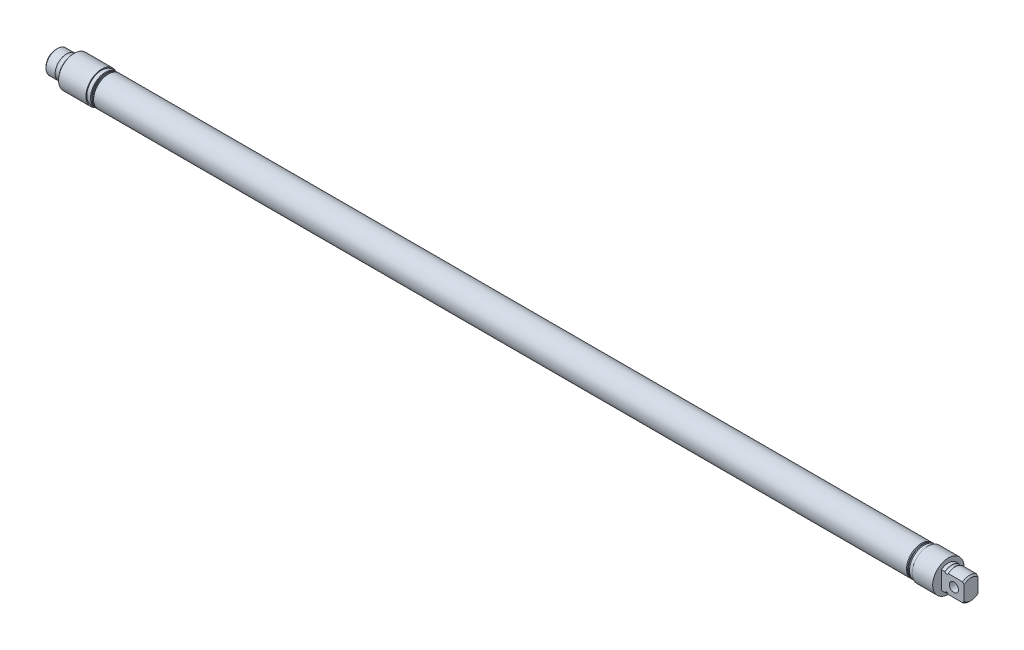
from build123d import *

# Parameters (mm, degrees)
SKETCH8_R           = 7.9375
BOSS_EXTRUDE1_DEPTH = 15.748
CUT_EXTRUDE1_REACH  = 637.95
SKETCH10_R          = 3.175
CUT_EXTRUDE2_DEPTH  = 9.652
CHAMFER1_SIZE       = 1.016
CHAMFER2_SIZE       = 1.016


with BuildPart() as part:
    # Sketch2 → Base-Revolve (revolve)
    with BuildSketch(Plane.XY, mode=Mode.PRIVATE) as base_revolve_sk:
        Polygon((605.79, 10.287), (31.75, 10.287), (31.75, 10.922), (12.7, 10.922), (12.7, 7.9375), (0, 7.9375), (0, 0), (620.014, 0), (620.014, 10.922), (605.79, 10.922), align=None)
    revolve(base_revolve_sk.sketch.rotate(Axis((-21.417447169, 0, 0), (1, 0, 0)), 90), axis=Axis((-21.417447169, 0, 0), (1, 0, 0)))

    # Sketch3 → Cut-Revolve1 (revolve, cut)
    with BuildSketch(Plane.XY, mode=Mode.PRIVATE) as cut_revolve1_sk:
        Polygon((34.29, 10.287), (34.29, 9.398), (35.179, 10.287), align=None)
        Polygon((35.56, 10.287), (35.56, 9.398), (36.449, 10.287), align=None)
    revolve(cut_revolve1_sk.sketch.rotate(Axis((0, 0, 0), (1, 0, 0)), 90), axis=Axis((0, 0, 0), (1, 0, 0)), mode=Mode.SUBTRACT)

    # Sketch6 → Cut-Revolve2 (revolve, cut)
    with BuildSketch(Plane.XY, mode=Mode.PRIVATE) as cut_revolve2_sk:
        Polygon((589.407, 0), (589.407, 9.525), (43.307, 9.525), (43.307, 3.175), (0, 3.175), (0, 0), align=None)
    revolve(cut_revolve2_sk.sketch.rotate(Axis((0, 0, 0), (-1, 0, 0)), 90), axis=Axis((0, 0, 0), (-1, 0, 0)), mode=Mode.SUBTRACT)

    # Sketch8 → Boss-Extrude1 (add)
    with BuildSketch(Plane(origin=(620.014, 0, 0), x_dir=(0, 0, -1), z_dir=(1, 0, 0))):
        with Locations(Location((0, 0, 0), (0, 0, 180))):
            Circle(SKETCH8_R)
    extrude(amount=BOSS_EXTRUDE1_DEPTH)

    # Sketch11 → Cut-Revolve3 (revolve, cut)
    with BuildSketch(Plane.XY, mode=Mode.PRIVATE) as cut_revolve3_sk:
        with BuildLine():
            Line((622.427, -7.9375), (624.713, -7.9375))
            ThreePointArc((624.713, -7.9375), (623.57, -7.221080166), (622.427, -7.9375))
        make_face()
    revolve(cut_revolve3_sk.sketch.rotate(Axis((0, 0, 0), (1, 0, 0)), 270), axis=Axis((0, 0, 0), (1, 0, 0)), mode=Mode.SUBTRACT)

    # Cut-Extrude1: up to this face of the body (flat: up to its plane)
    cut_extrude1_end = Plane(part.part.faces().sort_by_distance((620.014, 0, -10.613079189))[0])
    # Sketch9 → Cut-Extrude1 (cut, up to the picked face)
    with BuildSketch(Plane(origin=(635.762, 0, 0), x_dir=(0, 0, -1), z_dir=(1, 0, 0)), mode=Mode.PRIVATE) as cut_extrude1_sk1:
        with BuildLine():
            Line((-4.826, 6.301875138), (-4.826, -6.301875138))
            ThreePointArc((-4.826, -6.301875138), (-7.9375, 0), (-4.826, 6.301875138))
        make_face()
    cut_extrude1_tool1 = split(extrude(cut_extrude1_sk1.sketch, amount=-CUT_EXTRUDE1_REACH, mode=Mode.PRIVATE), bisect_by=cut_extrude1_end, keep=Keep.BOTH, mode=Mode.PRIVATE)
    # Sketch9 → Cut-Extrude1 (cut, up to the picked face)
    with BuildSketch(Plane(origin=(635.762, 0, 0), x_dir=(0, 0, -1), z_dir=(1, 0, 0)), mode=Mode.PRIVATE) as cut_extrude1_sk2:
        with BuildLine():
            Line((4.826, 6.301875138), (4.826, -6.301875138))
            ThreePointArc((4.826, -6.301875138), (7.9375, 0), (4.826, 6.301875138))
        make_face()
    cut_extrude1_tool2 = split(extrude(cut_extrude1_sk2.sketch, amount=-CUT_EXTRUDE1_REACH, mode=Mode.PRIVATE), bisect_by=cut_extrude1_end, keep=Keep.BOTH, mode=Mode.PRIVATE)
    add(cut_extrude1_tool1.solids().sort_by(Axis((635.762, 0, 6.094209), (-1, 0, 0)))[0], mode=Mode.SUBTRACT)
    add(cut_extrude1_tool2.solids().sort_by(Axis((635.762, 0, -6.094209), (-1, 0, 0)))[0], mode=Mode.SUBTRACT)

    # Sketch10 → Cut-Extrude2 (cut)
    with BuildSketch(Plane.XY.offset(4.826)):
        with Locations((628.65, 0)):
            Circle(SKETCH10_R)
    extrude(amount=-CUT_EXTRUDE2_DEPTH, mode=Mode.SUBTRACT)

    # Sketch12 → Cut-Revolve4 (revolve, cut)
    with BuildSketch(Plane.XY, mode=Mode.PRIVATE) as cut_revolve4_sk:
        with BuildLine():
            Line((7.366, -7.9375), (10.414, -7.9375))
            ThreePointArc((10.414, -7.9375), (8.89, -7.249541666), (7.366, -7.9375))
        make_face()
    revolve(cut_revolve4_sk.sketch.rotate(Axis((-3.558929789, 0, 0), (1, 0, 0)), 270), axis=Axis((-3.558929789, 0, 0), (1, 0, 0)), mode=Mode.SUBTRACT)

    # Sketch13 → Cut-Revolve5 (revolve, cut)
    with BuildSketch(Plane.XY, mode=Mode.PRIVATE) as cut_revolve5_sk:
        Polygon((601.218, 10.287), (601.98, 10.287), (601.98, 9.525), align=None)
        Polygon((602.488, 10.287), (603.25, 10.287), (603.25, 9.525), align=None)
    revolve(cut_revolve5_sk.sketch.rotate(Axis((-1.039644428, 0, 0), (1, 0, 0)), 90), axis=Axis((-1.039644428, 0, 0), (1, 0, 0)), mode=Mode.SUBTRACT)

    # Chamfer1
    chamfer1_edges = [part.edges().sort_by_distance(p)[0] for p in [
        (635.762, 7.9375, 0),
        (635.762, -7.9375, 0),
    ]]
    chamfer(chamfer1_edges, length=CHAMFER1_SIZE)

    # Chamfer2
    chamfer2_edges = [part.edges().sort_by_distance(p)[0] for p in [
        (0, 0, -7.9375),
    ]]
    chamfer(chamfer2_edges, length=CHAMFER2_SIZE)


solid = part.part
